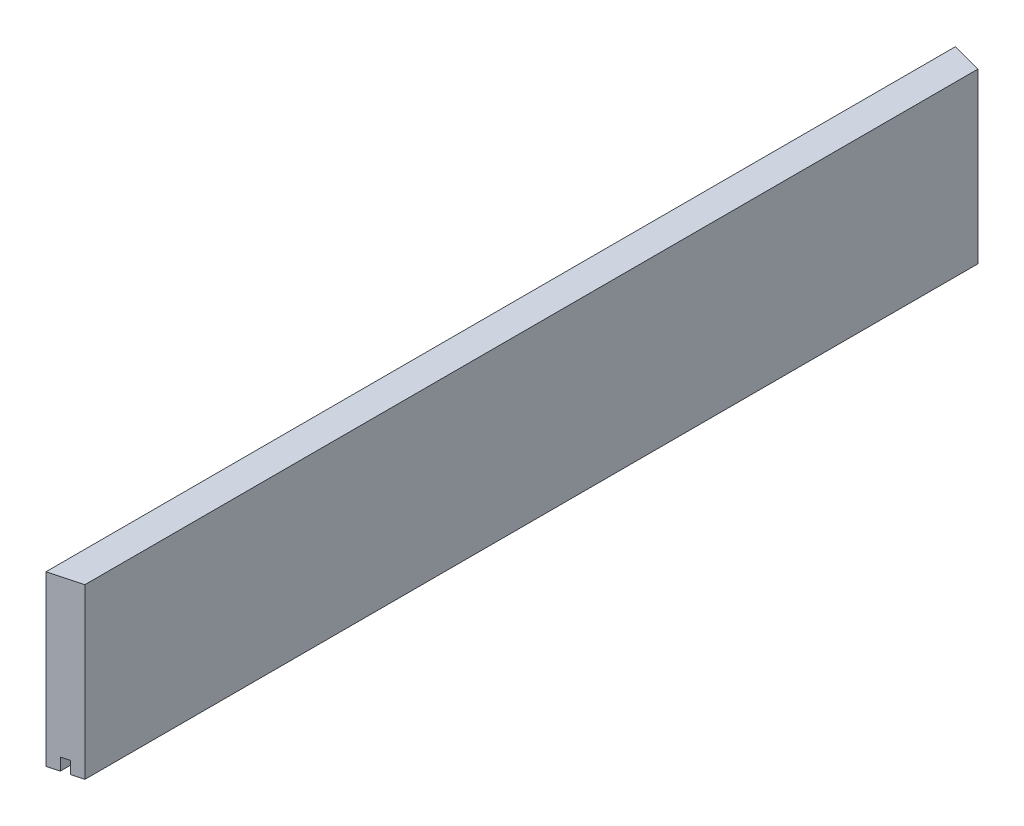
ISO-10303-21;
HEADER;
FILE_DESCRIPTION(('STEP AP214'),'2;1');
FILE_NAME('part.step','',(''),(''),'','','');
FILE_SCHEMA(('AUTOMOTIVE_DESIGN { 1 0 10303 214 1 1 1 1 }'));
ENDSEC;
DATA;
#1=APPLICATION_CONTEXT('core data for automotive mechanical design processes');
#2=APPLICATION_PROTOCOL_DEFINITION('international standard','automotive_design',2000,#1);
#3=PRODUCT_CONTEXT('',#1,'mechanical');
#4=PRODUCT('Part','Part','',(#3));
#5=PRODUCT_RELATED_PRODUCT_CATEGORY('part','',(#4));
#6=PRODUCT_DEFINITION_FORMATION('','',#4);
#7=PRODUCT_DEFINITION_CONTEXT('part definition',#1,'design');
#8=PRODUCT_DEFINITION('design','',#6,#7);
#9=PRODUCT_DEFINITION_SHAPE('','',#8);
#10=(LENGTH_UNIT() NAMED_UNIT(*) SI_UNIT(.MILLI.,.METRE.));
#11=(NAMED_UNIT(*) PLANE_ANGLE_UNIT() SI_UNIT($,.RADIAN.));
#12=(NAMED_UNIT(*) SI_UNIT($,.STERADIAN.) SOLID_ANGLE_UNIT());
#13=UNCERTAINTY_MEASURE_WITH_UNIT(LENGTH_MEASURE(1.E-05),#10,'distance_accuracy_value','');
#14=(GEOMETRIC_REPRESENTATION_CONTEXT(3) GLOBAL_UNCERTAINTY_ASSIGNED_CONTEXT((#13)) GLOBAL_UNIT_ASSIGNED_CONTEXT((#10,
#11,#12)) REPRESENTATION_CONTEXT('',''));
#15=CARTESIAN_POINT('',(0.,0.,0.));
#16=DIRECTION('',(0.,0.,1.));
#17=DIRECTION('',(1.,0.,0.));
#18=AXIS2_PLACEMENT_3D('',#15,#16,#17);
#19=CARTESIAN_POINT('',(0.,-35.25,445.));
#20=DIRECTION('',(0.,1.,0.));
#21=DIRECTION('',(0.,0.,1.));
#22=AXIS2_PLACEMENT_3D('',#19,#20,#21);
#23=PLANE('',#22);
#24=DIRECTION('',(0.,0.,-1.));
#25=VECTOR('',#24,1.);
#26=CARTESIAN_POINT('',(2.,-35.25,445.));
#27=LINE('',#26,#25);
#28=CARTESIAN_POINT('',(2.,-35.25,442.454482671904));
#29=VERTEX_POINT('',#28);
#30=CARTESIAN_POINT('',(2.00000000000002,-35.25,2.54551732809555));
#31=VERTEX_POINT('',#30);
#32=EDGE_CURVE('E11',#29,#31,#27,.T.);
#33=ORIENTED_EDGE('',*,*,#32,.F.);
#34=DIRECTION('',(-0.965925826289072,0.,0.258819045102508));
#35=VECTOR('',#34,1.);
#36=CARTESIAN_POINT('',(-0.502404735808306,-35.25,443.125));
#37=LINE('',#36,#35);
#38=CARTESIAN_POINT('',(-2.,-35.25,443.526279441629));
#39=VERTEX_POINT('',#38);
#40=EDGE_CURVE('E155',#29,#39,#37,.T.);
#41=ORIENTED_EDGE('',*,*,#40,.T.);
#42=DIRECTION('',(0.,0.,-1.));
#43=VECTOR('',#42,1.);
#44=CARTESIAN_POINT('',(-2.,-35.25,445.));
#45=LINE('',#44,#43);
#46=CARTESIAN_POINT('',(-2.,-35.25,1.47372055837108));
#47=VERTEX_POINT('',#46);
#48=EDGE_CURVE('E97',#39,#47,#45,.T.);
#49=ORIENTED_EDGE('',*,*,#48,.T.);
#50=DIRECTION('',(-0.965925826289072,0.,-0.258819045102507));
#51=VECTOR('',#50,1.);
#52=CARTESIAN_POINT('',(110.747595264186,-35.25,31.6843476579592));
#53=LINE('',#52,#51);
#54=EDGE_CURVE('E146',#31,#47,#53,.T.);
#55=ORIENTED_EDGE('',*,*,#54,.F.);
#56=EDGE_LOOP('',(#33,#41,#49,#55));
#57=FACE_BOUND('',#56,.T.);
#58=ADVANCED_FACE('F32',(#57),#23,.F.);
#59=CARTESIAN_POINT('',(1.99999999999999,0.,445.));
#60=DIRECTION('',(1.,0.,0.));
#61=DIRECTION('',(0.,1.,0.));
#62=AXIS2_PLACEMENT_3D('',#59,#60,#61);
#63=PLANE('',#62);
#64=DIRECTION('',(0.,0.,-1.));
#65=VECTOR('',#64,1.);
#66=CARTESIAN_POINT('',(2.,-41.25,445.));
#67=LINE('',#66,#65);
#68=CARTESIAN_POINT('',(2.,-41.25,442.454482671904));
#69=VERTEX_POINT('',#68);
#70=CARTESIAN_POINT('',(2.00000000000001,-41.25,2.54551732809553));
#71=VERTEX_POINT('',#70);
#72=EDGE_CURVE('E40',#69,#71,#67,.T.);
#73=ORIENTED_EDGE('',*,*,#72,.F.);
#74=DIRECTION('',(0.,1.,0.));
#75=VECTOR('',#74,1.);
#76=CARTESIAN_POINT('',(1.99999999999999,0.,442.454482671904));
#77=LINE('',#76,#75);
#78=EDGE_CURVE('E165',#69,#29,#77,.T.);
#79=ORIENTED_EDGE('',*,*,#78,.T.);
#80=ORIENTED_EDGE('',*,*,#32,.T.);
#81=DIRECTION('',(0.,1.,0.));
#82=VECTOR('',#81,1.);
#83=CARTESIAN_POINT('',(1.99999999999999,0.,2.54551732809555));
#84=LINE('',#83,#82);
#85=EDGE_CURVE('E137',#71,#31,#84,.T.);
#86=ORIENTED_EDGE('',*,*,#85,.F.);
#87=EDGE_LOOP('',(#73,#79,#80,#86));
#88=FACE_BOUND('',#87,.T.);
#89=ADVANCED_FACE('F144',(#88),#63,.F.);
#90=CARTESIAN_POINT('',(0.,-41.25,445.));
#91=DIRECTION('',(0.,1.,0.));
#92=DIRECTION('',(0.,0.,1.));
#93=AXIS2_PLACEMENT_3D('',#90,#91,#92);
#94=PLANE('',#93);
#95=DIRECTION('',(0.,0.,-1.));
#96=VECTOR('',#95,1.);
#97=CARTESIAN_POINT('',(7.50000000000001,-41.25,445.));
#98=LINE('',#97,#96);
#99=CARTESIAN_POINT('',(7.49999999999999,-41.25,440.980762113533));
#100=VERTEX_POINT('',#99);
#101=CARTESIAN_POINT('',(7.49999999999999,-41.25,4.01923788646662));
#102=VERTEX_POINT('',#101);
#103=EDGE_CURVE('E120',#100,#102,#98,.T.);
#104=ORIENTED_EDGE('',*,*,#103,.F.);
#105=DIRECTION('',(-0.965925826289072,0.,0.258819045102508));
#106=VECTOR('',#105,1.);
#107=CARTESIAN_POINT('',(7.49999999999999,-41.25,440.980762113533));
#108=LINE('',#107,#106);
#109=EDGE_CURVE('E107',#100,#69,#108,.T.);
#110=ORIENTED_EDGE('',*,*,#109,.T.);
#111=ORIENTED_EDGE('',*,*,#72,.T.);
#112=DIRECTION('',(-0.965925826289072,0.,-0.258819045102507));
#113=VECTOR('',#112,1.);
#114=CARTESIAN_POINT('',(7.49999999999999,-41.25,4.01923788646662));
#115=LINE('',#114,#113);
#116=EDGE_CURVE('E128',#102,#71,#115,.T.);
#117=ORIENTED_EDGE('',*,*,#116,.F.);
#118=EDGE_LOOP('',(#104,#110,#111,#117));
#119=FACE_BOUND('',#118,.T.);
#120=ADVANCED_FACE('F127',(#119),#94,.F.);
#121=CARTESIAN_POINT('',(7.5,0.,445.));
#122=DIRECTION('',(1.,0.,0.));
#123=DIRECTION('',(0.,1.,0.));
#124=AXIS2_PLACEMENT_3D('',#121,#122,#123);
#125=PLANE('',#124);
#126=DIRECTION('',(0.,1.,0.));
#127=VECTOR('',#126,1.);
#128=CARTESIAN_POINT('',(7.49999999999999,-41.25,440.980762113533));
#129=LINE('',#128,#127);
#130=CARTESIAN_POINT('',(7.49999999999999,41.25,440.980762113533));
#131=VERTEX_POINT('',#130);
#132=EDGE_CURVE('E108',#100,#131,#129,.T.);
#133=ORIENTED_EDGE('',*,*,#132,.F.);
#134=ORIENTED_EDGE('',*,*,#103,.T.);
#135=DIRECTION('',(0.,1.,0.));
#136=VECTOR('',#135,1.);
#137=CARTESIAN_POINT('',(7.49999999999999,-41.25,4.01923788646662));
#138=LINE('',#137,#136);
#139=CARTESIAN_POINT('',(7.49999999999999,41.25,4.01923788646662));
#140=VERTEX_POINT('',#139);
#141=EDGE_CURVE('E141',#102,#140,#138,.T.);
#142=ORIENTED_EDGE('',*,*,#141,.T.);
#143=DIRECTION('',(0.,0.,-1.));
#144=VECTOR('',#143,1.);
#145=CARTESIAN_POINT('',(7.49999999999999,41.25,445.));
#146=LINE('',#145,#144);
#147=EDGE_CURVE('E114',#131,#140,#146,.T.);
#148=ORIENTED_EDGE('',*,*,#147,.F.);
#149=EDGE_LOOP('',(#133,#134,#142,#148));
#150=FACE_BOUND('',#149,.T.);
#151=ADVANCED_FACE('F176',(#150),#125,.T.);
#152=CARTESIAN_POINT('',(0.,41.25,445.));
#153=DIRECTION('',(0.,1.,0.));
#154=DIRECTION('',(0.,0.,1.));
#155=AXIS2_PLACEMENT_3D('',#152,#153,#154);
#156=PLANE('',#155);
#157=DIRECTION('',(-0.965925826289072,0.,0.258819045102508));
#158=VECTOR('',#157,1.);
#159=CARTESIAN_POINT('',(7.49999999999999,41.25,440.980762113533));
#160=LINE('',#159,#158);
#161=CARTESIAN_POINT('',(-7.50000000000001,41.25,445.));
#162=VERTEX_POINT('',#161);
#163=EDGE_CURVE('E46',#131,#162,#160,.T.);
#164=ORIENTED_EDGE('',*,*,#163,.F.);
#165=ORIENTED_EDGE('',*,*,#147,.T.);
#166=DIRECTION('',(-0.965925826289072,0.,-0.258819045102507));
#167=VECTOR('',#166,1.);
#168=CARTESIAN_POINT('',(7.49999999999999,41.25,4.01923788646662));
#169=LINE('',#168,#167);
#170=CARTESIAN_POINT('',(-7.50000000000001,41.25,0.));
#171=VERTEX_POINT('',#170);
#172=EDGE_CURVE('E162',#140,#171,#169,.T.);
#173=ORIENTED_EDGE('',*,*,#172,.T.);
#174=DIRECTION('',(0.,0.,-1.));
#175=VECTOR('',#174,1.);
#176=CARTESIAN_POINT('',(-7.50000000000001,41.25,445.));
#177=LINE('',#176,#175);
#178=EDGE_CURVE('E112',#162,#171,#177,.T.);
#179=ORIENTED_EDGE('',*,*,#178,.F.);
#180=EDGE_LOOP('',(#164,#165,#173,#179));
#181=FACE_BOUND('',#180,.T.);
#182=ADVANCED_FACE('F175',(#181),#156,.T.);
#183=DIRECTION('',(0.,0.,-1.));
#184=VECTOR('',#183,1.);
#185=CARTESIAN_POINT('',(-2.,-41.25,445.));
#186=LINE('',#185,#184);
#187=CARTESIAN_POINT('',(-2.,-41.25,443.526279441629));
#188=VERTEX_POINT('',#187);
#189=CARTESIAN_POINT('',(-2.,-41.25,1.47372055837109));
#190=VERTEX_POINT('',#189);
#191=EDGE_CURVE('E106',#188,#190,#186,.T.);
#192=ORIENTED_EDGE('',*,*,#191,.F.);
#193=CARTESIAN_POINT('',(-7.50000000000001,-41.25,445.));
#194=VERTEX_POINT('',#193);
#195=EDGE_CURVE('E92',#188,#194,#108,.T.);
#196=ORIENTED_EDGE('',*,*,#195,.T.);
#197=DIRECTION('',(0.,0.,-1.));
#198=VECTOR('',#197,1.);
#199=CARTESIAN_POINT('',(-7.49999999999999,-41.25,445.));
#200=LINE('',#199,#198);
#201=CARTESIAN_POINT('',(-7.49999999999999,-41.25,0.));
#202=VERTEX_POINT('',#201);
#203=EDGE_CURVE('E105',#194,#202,#200,.T.);
#204=ORIENTED_EDGE('',*,*,#203,.T.);
#205=EDGE_CURVE('E142',#190,#202,#115,.T.);
#206=ORIENTED_EDGE('',*,*,#205,.F.);
#207=EDGE_LOOP('',(#192,#196,#204,#206));
#208=FACE_BOUND('',#207,.T.);
#209=ADVANCED_FACE('F103',(#208),#94,.F.);
#210=CARTESIAN_POINT('',(-2.00000000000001,0.,445.));
#211=DIRECTION('',(1.,0.,0.));
#212=DIRECTION('',(0.,1.,0.));
#213=AXIS2_PLACEMENT_3D('',#210,#211,#212);
#214=PLANE('',#213);
#215=DIRECTION('',(0.,1.,0.));
#216=VECTOR('',#215,1.);
#217=CARTESIAN_POINT('',(-2.00000000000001,0.,443.526279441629));
#218=LINE('',#217,#216);
#219=EDGE_CURVE('E168',#188,#39,#218,.T.);
#220=ORIENTED_EDGE('',*,*,#219,.F.);
#221=ORIENTED_EDGE('',*,*,#191,.T.);
#222=DIRECTION('',(0.,1.,0.));
#223=VECTOR('',#222,1.);
#224=CARTESIAN_POINT('',(-2.00000000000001,0.,1.47372055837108));
#225=LINE('',#224,#223);
#226=EDGE_CURVE('E149',#190,#47,#225,.T.);
#227=ORIENTED_EDGE('',*,*,#226,.T.);
#228=ORIENTED_EDGE('',*,*,#48,.F.);
#229=EDGE_LOOP('',(#220,#221,#227,#228));
#230=FACE_BOUND('',#229,.T.);
#231=ADVANCED_FACE('F159',(#230),#214,.T.);
#232=CARTESIAN_POINT('',(-7.5,0.,445.));
#233=DIRECTION('',(1.,0.,0.));
#234=DIRECTION('',(0.,1.,0.));
#235=AXIS2_PLACEMENT_3D('',#232,#233,#234);
#236=PLANE('',#235);
#237=DIRECTION('',(0.,-1.,0.));
#238=VECTOR('',#237,1.);
#239=CARTESIAN_POINT('',(-7.5,0.,0.));
#240=LINE('',#239,#238);
#241=EDGE_CURVE('E98',#171,#202,#240,.T.);
#242=ORIENTED_EDGE('',*,*,#241,.T.);
#243=ORIENTED_EDGE('',*,*,#203,.F.);
#244=DIRECTION('',(0.,-1.,0.));
#245=VECTOR('',#244,1.);
#246=CARTESIAN_POINT('',(-7.5,0.,445.));
#247=LINE('',#246,#245);
#248=EDGE_CURVE('E89',#162,#194,#247,.T.);
#249=ORIENTED_EDGE('',*,*,#248,.F.);
#250=ORIENTED_EDGE('',*,*,#178,.T.);
#251=EDGE_LOOP('',(#242,#243,#249,#250));
#252=FACE_BOUND('',#251,.T.);
#253=ADVANCED_FACE('F111',(#252),#236,.F.);
#254=CARTESIAN_POINT('',(7.49999999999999,-41.25,4.01923788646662));
#255=DIRECTION('',(0.258819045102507,0.,-0.965925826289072));
#256=DIRECTION('',(-0.965925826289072,0.,-0.258819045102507));
#257=AXIS2_PLACEMENT_3D('',#254,#255,#256);
#258=PLANE('',#257);
#259=ORIENTED_EDGE('',*,*,#85,.T.);
#260=ORIENTED_EDGE('',*,*,#54,.T.);
#261=ORIENTED_EDGE('',*,*,#226,.F.);
#262=ORIENTED_EDGE('',*,*,#205,.T.);
#263=ORIENTED_EDGE('',*,*,#241,.F.);
#264=ORIENTED_EDGE('',*,*,#172,.F.);
#265=ORIENTED_EDGE('',*,*,#141,.F.);
#266=ORIENTED_EDGE('',*,*,#116,.T.);
#267=EDGE_LOOP('',(#259,#260,#261,#262,#263,#264,#265,#266));
#268=FACE_BOUND('',#267,.T.);
#269=ADVANCED_FACE('F135',(#268),#258,.T.);
#270=CARTESIAN_POINT('',(7.49999999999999,-41.25,440.980762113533));
#271=DIRECTION('',(-0.258819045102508,0.,-0.965925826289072));
#272=DIRECTION('',(-0.965925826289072,0.,0.258819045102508));
#273=AXIS2_PLACEMENT_3D('',#270,#271,#272);
#274=PLANE('',#273);
#275=ORIENTED_EDGE('',*,*,#109,.F.);
#276=ORIENTED_EDGE('',*,*,#132,.T.);
#277=ORIENTED_EDGE('',*,*,#163,.T.);
#278=ORIENTED_EDGE('',*,*,#248,.T.);
#279=ORIENTED_EDGE('',*,*,#195,.F.);
#280=ORIENTED_EDGE('',*,*,#219,.T.);
#281=ORIENTED_EDGE('',*,*,#40,.F.);
#282=ORIENTED_EDGE('',*,*,#78,.F.);
#283=EDGE_LOOP('',(#275,#276,#277,#278,#279,#280,#281,#282));
#284=FACE_BOUND('',#283,.T.);
#285=ADVANCED_FACE('F91',(#284),#274,.F.);
#286=CLOSED_SHELL('',(#58,#89,#120,#151,#182,#209,#231,#253,#269,#285));
#287=MANIFOLD_SOLID_BREP('B2',#286);
#288=ADVANCED_BREP_SHAPE_REPRESENTATION('',(#18,#287),#14);
#289=SHAPE_DEFINITION_REPRESENTATION(#9,#288);
ENDSEC;
END-ISO-10303-21;
